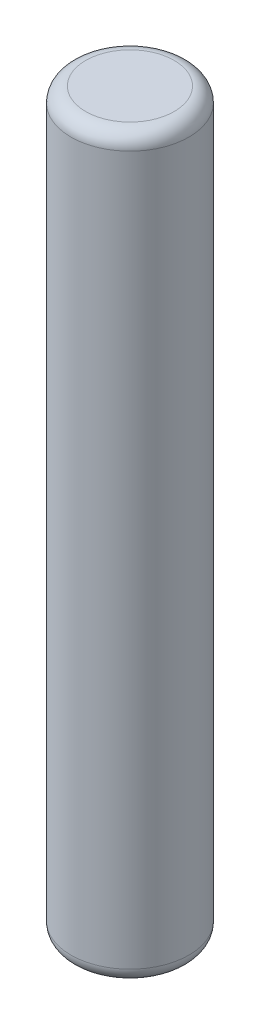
from build123d import *

# Parameters (mm, degrees)
SKETCH1_R           = 4
BOSS_EXTRUDE1_DEPTH = 50
FILLET1_R           = 1
FILLET2_R           = 1


with BuildPart() as part:
    # Sketch1 → Boss-Extrude1 (new body)
    with BuildSketch(Plane(origin=(0, 0, 0), x_dir=(1, 0, 0), z_dir=(0, 1, 0))):
        with Locations(Location((0, 0, 0), (0, 0, 270))):
            Circle(SKETCH1_R)
    extrude(amount=BOSS_EXTRUDE1_DEPTH)

    # Fillet1
    fillet1_edges = [part.edges().sort_by_distance(p)[0] for p in [
        (0, 50, -4),
    ]]
    fillet(fillet1_edges, radius=FILLET1_R)

    # Fillet2
    fillet2_edges = [part.edges().sort_by_distance(p)[0] for p in [
        (0, 0, -4),
    ]]
    fillet(fillet2_edges, radius=FILLET2_R)


solid = part.part
